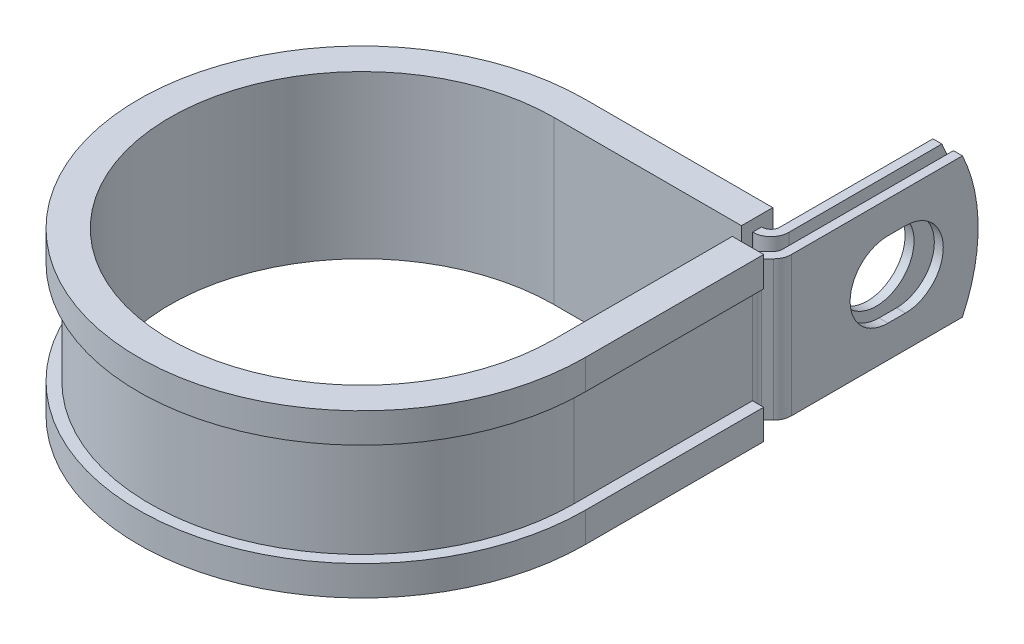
from build123d import *

# Parameters (mm, degrees)
EXTRUDE_THIN1_DEPTH = 9.525
SKETCH2_R           = 5.1562
CUT_EXTRUDE1_DEPTH  = 1.2192
CUT_EXTRUDE2_DEPTH  = 1.2192
CUT_EXTRUDE3_DEPTH  = 78.617668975


with BuildPart() as part:
    # Sketch1 → Extrude-Thin1 (new, symmetric)
    with BuildSketch(Plane(origin=(0, 0, 0), x_dir=(1, 0, 0), z_dir=(0, 1, 0))):
        with BuildLine():
            Line((29.6088698, 53.1622), (29.6088698, 27.7114))
            ThreePointArc((29.6088698, 27.7114), (29.516063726, 27.244832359), (29.251774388, 26.849295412))
            Line((29.251774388, 26.849295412), (28.425590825, 26.023111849))
            ThreePointArc((28.425590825, 26.023111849), (27.897012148, 25.232037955), (27.7114, 24.298902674))
            Line((27.7114, 24.298902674), (27.7114, 0))
            ThreePointArc((27.7114, 0), (-19.594918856, -19.594918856), (0, 27.7114))
            Line((0, 27.7114), (25.5956698, 27.7114))
            ThreePointArc((25.5956698, 27.7114), (27.319878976, 28.425590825), (28.0340698, 30.1498))
            Line((28.0340698, 30.1498), (28.0340698, 53.1622))
            Line((28.0340698, 53.1622), (26.8148698, 53.1622))
            Line((26.8148698, 53.1622), (26.8148698, 30.1498))
            ThreePointArc((26.8148698, 30.1498), (26.457774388, 29.287695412), (25.5956698, 28.9306))
            Line((25.5956698, 28.9306), (0, 28.9306))
            ThreePointArc((0, 28.9306), (-20.457023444, -20.457023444), (28.9306, 0))
            Line((28.9306, 0), (28.9306, 24.298902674))
            ThreePointArc((28.9306, 24.298902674), (29.023406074, 24.765470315), (29.287695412, 25.161007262))
            Line((29.287695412, 25.161007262), (30.113878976, 25.987190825))
            ThreePointArc((30.113878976, 25.987190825), (30.642457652, 26.778264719), (30.8280698, 27.7114))
            Line((30.8280698, 27.7114), (30.8280698, 53.1622))
            Line((30.8280698, 53.1622), (29.6088698, 53.1622))
        make_face()
    extrude(amount=EXTRUDE_THIN1_DEPTH, both=True)

    # Sketch2 → Cut-Extrude1 (cut)
    with BuildSketch(Plane.ZY.offset(-26.8148698)):
        with Locations((-42.0624, 0)):
            Circle(SKETCH2_R)
    extrude(amount=-CUT_EXTRUDE1_DEPTH, mode=Mode.SUBTRACT)

    # Sketch3 → Cut-Extrude2 (cut)
    with BuildSketch(Plane(origin=(30.8280698, 0, 0), x_dir=(0, 0, -1), z_dir=(1, 0, 0))):
        with BuildLine():
            Line((40.8686, 5.1562), (43.2562, 5.1562))
            ThreePointArc((43.2562, 5.1562), (48.4124, 0), (43.2562, -5.1562))
            Line((43.2562, -5.1562), (40.8686, -5.1562))
            ThreePointArc((40.8686, -5.1562), (35.7124, 0), (40.8686, 5.1562))
        make_face()
    extrude(amount=-CUT_EXTRUDE2_DEPTH, mode=Mode.SUBTRACT)

    # Sketch4 → Cut-Extrude3 (cut, through all)
    with BuildSketch(Plane.ZY.offset(-26.8148698)):
        with BuildLine():
            Line((-51.017663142, 9.525), (-53.1622, 9.525))
            Line((-53.1622, 9.525), (-53.1622, -2.73e-07))
            ThreePointArc((-53.1622, -2.73e-07), (-52.619438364, 4.881717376), (-51.017663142, 9.525))
        make_face()
        with BuildLine():
            ThreePointArc((-51.017663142, -9.525), (-52.619438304, -4.881717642), (-53.1622, -2.73e-07))
            Line((-53.1622, -2.73e-07), (-53.1622, -9.525))
            Line((-53.1622, -9.525), (-51.017663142, -9.525))
        make_face()
    extrude(amount=-CUT_EXTRUDE3_DEPTH, mode=Mode.SUBTRACT)

    # Sweep1: sweep along a path in Sketch6
    with BuildLine(Plane(origin=(0, 9.525, 0), x_dir=(1, 0, 0), z_dir=(0, 1, 0))) as sweep1_path:
        Line((26.1874, 24.298902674), (26.1874, 0))
        ThreePointArc((26.1874, 0), (-18.517288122, -18.517288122), (0, 26.1874))
        Line((0, 26.1874), (25.5448698, 26.1874))
    # Sketch5 → Sweep1 (sweep)
    with BuildSketch(Plane(origin=(0, 0, -24.298902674), x_dir=(-1, 0, 0), z_dir=(0, 0, -1))):
        Polygon((-28.9306, 9.525), (-27.7114, 9.525), (-27.7114, -9.525), (-28.9306, -9.525), (-28.9306, -6.985), (-30.4546, -6.985), (-30.4546, -11.049), (-26.1874, -11.049), (-26.1874, 11.049), (-30.4546, 11.049), (-30.4546, 6.985), (-28.9306, 6.985), align=None)
    sweep(path=sweep1_path.line)


solid = part.part
